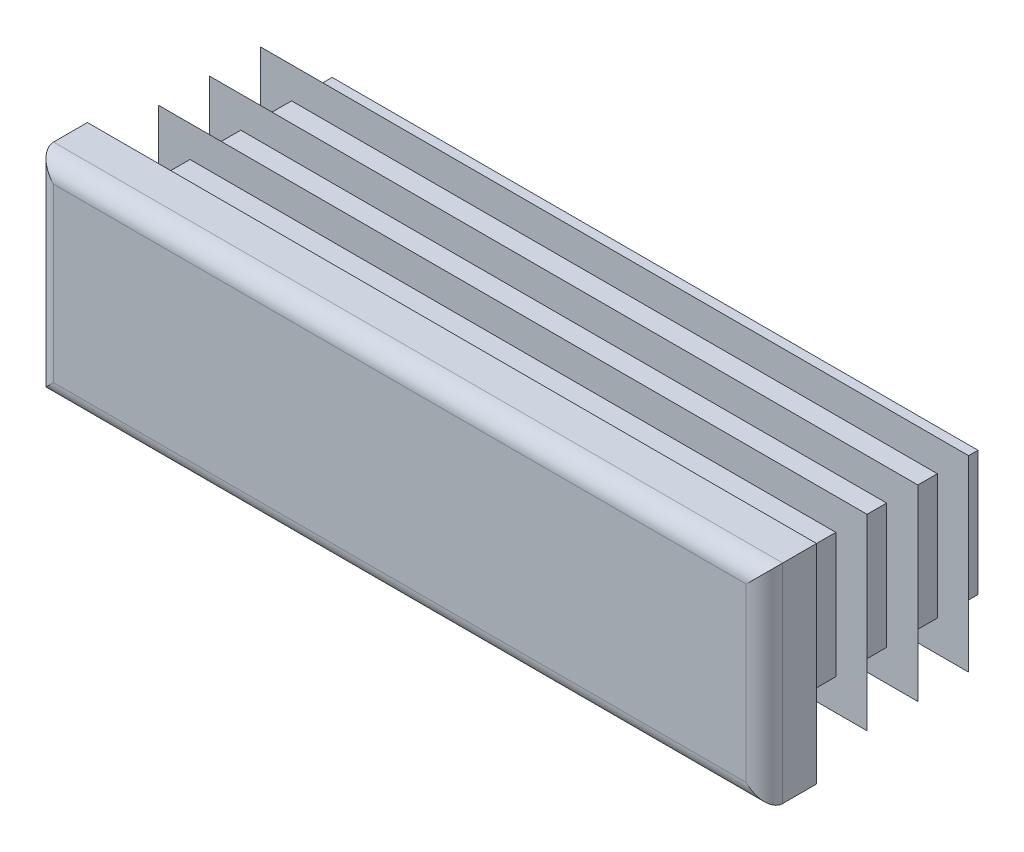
ISO-10303-21;
HEADER;
FILE_DESCRIPTION(('STEP AP214'),'2;1');
FILE_NAME('part.step','',(''),(''),'','','');
FILE_SCHEMA(('AUTOMOTIVE_DESIGN { 1 0 10303 214 1 1 1 1 }'));
ENDSEC;
DATA;
#1=APPLICATION_CONTEXT('core data for automotive mechanical design processes');
#2=APPLICATION_PROTOCOL_DEFINITION('international standard','automotive_design',2000,#1);
#3=PRODUCT_CONTEXT('',#1,'mechanical');
#4=PRODUCT('Part','Part','',(#3));
#5=PRODUCT_RELATED_PRODUCT_CATEGORY('part','',(#4));
#6=PRODUCT_DEFINITION_FORMATION('','',#4);
#7=PRODUCT_DEFINITION_CONTEXT('part definition',#1,'design');
#8=PRODUCT_DEFINITION('design','',#6,#7);
#9=PRODUCT_DEFINITION_SHAPE('','',#8);
#10=(LENGTH_UNIT() NAMED_UNIT(*) SI_UNIT(.MILLI.,.METRE.));
#11=(NAMED_UNIT(*) PLANE_ANGLE_UNIT() SI_UNIT($,.RADIAN.));
#12=(NAMED_UNIT(*) SI_UNIT($,.STERADIAN.) SOLID_ANGLE_UNIT());
#13=UNCERTAINTY_MEASURE_WITH_UNIT(LENGTH_MEASURE(1.E-05),#10,'distance_accuracy_value','');
#14=(GEOMETRIC_REPRESENTATION_CONTEXT(3) GLOBAL_UNCERTAINTY_ASSIGNED_CONTEXT((#13)) GLOBAL_UNIT_ASSIGNED_CONTEXT((#10,
#11,#12)) REPRESENTATION_CONTEXT('',''));
#15=CARTESIAN_POINT('',(0.,0.,0.));
#16=DIRECTION('',(0.,0.,1.));
#17=DIRECTION('',(1.,0.,0.));
#18=AXIS2_PLACEMENT_3D('',#15,#16,#17);
#19=CARTESIAN_POINT('',(33.25,-10.,5.));
#20=DIRECTION('',(0.,0.,-1.));
#21=DIRECTION('',(0.,1.,0.));
#22=AXIS2_PLACEMENT_3D('',#19,#20,#21);
#23=PLANE('',#22);
#24=DIRECTION('',(0.,1.,0.));
#25=VECTOR('',#24,1.);
#26=CARTESIAN_POINT('',(-33.25,-10.,5.));
#27=LINE('',#26,#25);
#28=CARTESIAN_POINT('',(-33.25,-8.25,5.));
#29=VERTEX_POINT('',#28);
#30=CARTESIAN_POINT('',(-33.25,8.25,5.));
#31=VERTEX_POINT('',#30);
#32=EDGE_CURVE('E310',#29,#31,#27,.T.);
#33=ORIENTED_EDGE('',*,*,#32,.F.);
#34=DIRECTION('',(-1.,0.,0.));
#35=VECTOR('',#34,1.);
#36=CARTESIAN_POINT('',(35.,-8.25,5.));
#37=LINE('',#36,#35);
#38=CARTESIAN_POINT('',(33.25,-8.25,5.));
#39=VERTEX_POINT('',#38);
#40=EDGE_CURVE('E482',#39,#29,#37,.T.);
#41=ORIENTED_EDGE('',*,*,#40,.F.);
#42=DIRECTION('',(0.,1.,0.));
#43=VECTOR('',#42,1.);
#44=CARTESIAN_POINT('',(33.25,-10.,5.));
#45=LINE('',#44,#43);
#46=CARTESIAN_POINT('',(33.25,8.25,5.));
#47=VERTEX_POINT('',#46);
#48=EDGE_CURVE('E305',#39,#47,#45,.T.);
#49=ORIENTED_EDGE('',*,*,#48,.T.);
#50=DIRECTION('',(-1.,0.,0.));
#51=VECTOR('',#50,1.);
#52=CARTESIAN_POINT('',(35.,8.25,5.));
#53=LINE('',#52,#51);
#54=EDGE_CURVE('E630',#47,#31,#53,.T.);
#55=ORIENTED_EDGE('',*,*,#54,.T.);
#56=EDGE_LOOP('',(#33,#41,#49,#55));
#57=FACE_BOUND('',#56,.T.);
#58=ADVANCED_FACE('F14',(#57),#23,.F.);
#59=CARTESIAN_POINT('',(-33.25,-10.,3.25));
#60=DIRECTION('',(0.,1.,0.));
#61=DIRECTION('',(-1.,0.,0.));
#62=AXIS2_PLACEMENT_3D('',#59,#60,#61);
#63=CYLINDRICAL_SURFACE('',#62,1.75);
#64=DIRECTION('',(0.,1.,0.));
#65=VECTOR('',#64,1.);
#66=CARTESIAN_POINT('',(-35.,-10.,3.25));
#67=LINE('',#66,#65);
#68=CARTESIAN_POINT('',(-35.,-10.,3.25));
#69=VERTEX_POINT('',#68);
#70=CARTESIAN_POINT('',(-35.,10.,3.25));
#71=VERTEX_POINT('',#70);
#72=EDGE_CURVE('E402',#69,#71,#67,.T.);
#73=ORIENTED_EDGE('',*,*,#72,.F.);
#74=CARTESIAN_POINT('',(-33.25,-8.25,3.25));
#75=DIRECTION('',(-0.707106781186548,0.707106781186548,0.));
#76=DIRECTION('',(0.707106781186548,0.707106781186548,0.));
#77=AXIS2_PLACEMENT_3D('',#74,#75,#76);
#78=ELLIPSE('',#77,2.47487373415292,1.75);
#79=EDGE_CURVE('E59',#69,#29,#78,.T.);
#80=ORIENTED_EDGE('',*,*,#79,.T.);
#81=ORIENTED_EDGE('',*,*,#32,.T.);
#82=CARTESIAN_POINT('',(-33.25,8.25,3.25));
#83=DIRECTION('',(0.707106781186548,0.707106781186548,0.));
#84=DIRECTION('',(-0.707106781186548,0.707106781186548,0.));
#85=AXIS2_PLACEMENT_3D('',#82,#83,#84);
#86=ELLIPSE('',#85,2.47487373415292,1.75);
#87=EDGE_CURVE('E306',#31,#71,#86,.F.);
#88=ORIENTED_EDGE('',*,*,#87,.T.);
#89=EDGE_LOOP('',(#73,#80,#81,#88));
#90=FACE_BOUND('',#89,.T.);
#91=ADVANCED_FACE('F16',(#90),#63,.T.);
#92=CARTESIAN_POINT('',(-35.,-10.,3.25));
#93=DIRECTION('',(1.,0.,0.));
#94=DIRECTION('',(0.,1.,0.));
#95=AXIS2_PLACEMENT_3D('',#92,#93,#94);
#96=PLANE('',#95);
#97=DIRECTION('',(0.,0.,-1.));
#98=VECTOR('',#97,1.);
#99=CARTESIAN_POINT('',(-35.,10.,3.25));
#100=LINE('',#99,#98);
#101=CARTESIAN_POINT('',(-35.,10.,0.));
#102=VERTEX_POINT('',#101);
#103=EDGE_CURVE('E615',#71,#102,#100,.T.);
#104=ORIENTED_EDGE('',*,*,#103,.T.);
#105=DIRECTION('',(0.,1.,0.));
#106=VECTOR('',#105,1.);
#107=CARTESIAN_POINT('',(-35.,-10.,0.));
#108=LINE('',#107,#106);
#109=CARTESIAN_POINT('',(-35.,-10.,0.));
#110=VERTEX_POINT('',#109);
#111=EDGE_CURVE('E400',#110,#102,#108,.T.);
#112=ORIENTED_EDGE('',*,*,#111,.F.);
#113=DIRECTION('',(0.,0.,-1.));
#114=VECTOR('',#113,1.);
#115=CARTESIAN_POINT('',(-35.,-10.,3.25));
#116=LINE('',#115,#114);
#117=EDGE_CURVE('E616',#69,#110,#116,.T.);
#118=ORIENTED_EDGE('',*,*,#117,.F.);
#119=ORIENTED_EDGE('',*,*,#72,.T.);
#120=EDGE_LOOP('',(#104,#112,#118,#119));
#121=FACE_BOUND('',#120,.T.);
#122=ADVANCED_FACE('F697',(#121),#96,.F.);
#123=CARTESIAN_POINT('',(-31.,-10.,0.));
#124=DIRECTION('',(1.,0.,0.));
#125=DIRECTION('',(0.,1.,0.));
#126=AXIS2_PLACEMENT_3D('',#123,#124,#125);
#127=PLANE('',#126);
#128=DIRECTION('',(0.,1.,0.));
#129=VECTOR('',#128,1.);
#130=CARTESIAN_POINT('',(-31.,-10.,0.));
#131=LINE('',#130,#129);
#132=CARTESIAN_POINT('',(-31.,-6.,0.));
#133=VERTEX_POINT('',#132);
#134=CARTESIAN_POINT('',(-31.,6.,0.));
#135=VERTEX_POINT('',#134);
#136=EDGE_CURVE('E397',#133,#135,#131,.T.);
#137=ORIENTED_EDGE('',*,*,#136,.T.);
#138=DIRECTION('',(0.,0.,-1.));
#139=VECTOR('',#138,1.);
#140=CARTESIAN_POINT('',(-31.,6.,0.));
#141=LINE('',#140,#139);
#142=CARTESIAN_POINT('',(-31.,6.,-0.975));
#143=VERTEX_POINT('',#142);
#144=EDGE_CURVE('E495',#135,#143,#141,.T.);
#145=ORIENTED_EDGE('',*,*,#144,.T.);
#146=DIRECTION('',(0.,1.,0.));
#147=VECTOR('',#146,1.);
#148=CARTESIAN_POINT('',(-31.,-10.,-0.975));
#149=LINE('',#148,#147);
#150=CARTESIAN_POINT('',(-31.,-6.,-0.975));
#151=VERTEX_POINT('',#150);
#152=EDGE_CURVE('E394',#151,#143,#149,.T.);
#153=ORIENTED_EDGE('',*,*,#152,.F.);
#154=DIRECTION('',(0.,0.,1.));
#155=VECTOR('',#154,1.);
#156=CARTESIAN_POINT('',(-31.,-6.,0.));
#157=LINE('',#156,#155);
#158=EDGE_CURVE('E489',#151,#133,#157,.T.);
#159=ORIENTED_EDGE('',*,*,#158,.T.);
#160=EDGE_LOOP('',(#137,#145,#153,#159));
#161=FACE_BOUND('',#160,.T.);
#162=ADVANCED_FACE('F787',(#161),#127,.F.);
#163=CARTESIAN_POINT('',(-34.,-10.,-0.975));
#164=DIRECTION('',(0.342020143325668,0.,0.939692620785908));
#165=DIRECTION('',(-0.939692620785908,0.,0.342020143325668));
#166=AXIS2_PLACEMENT_3D('',#163,#164,#165);
#167=PLANE('',#166);
#168=DIRECTION('',(0.,1.,0.));
#169=VECTOR('',#168,1.);
#170=CARTESIAN_POINT('',(-34.,-10.,-0.975));
#171=LINE('',#170,#169);
#172=CARTESIAN_POINT('',(-34.,-9.,-0.975));
#173=VERTEX_POINT('',#172);
#174=CARTESIAN_POINT('',(-34.,9.,-0.975));
#175=VERTEX_POINT('',#174);
#176=EDGE_CURVE('E392',#173,#175,#171,.T.);
#177=ORIENTED_EDGE('',*,*,#176,.T.);
#178=DIRECTION('',(0.844349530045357,-0.438895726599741,-0.307318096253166));
#179=VECTOR('',#178,1.);
#180=CARTESIAN_POINT('',(-26.9589533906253,5.34004028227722,-3.53773138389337));
#181=LINE('',#180,#179);
#182=CARTESIAN_POINT('',(-31.,7.44058990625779,-2.06691070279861));
#183=VERTEX_POINT('',#182);
#184=EDGE_CURVE('E519',#175,#183,#181,.T.);
#185=ORIENTED_EDGE('',*,*,#184,.T.);
#186=DIRECTION('',(0.,1.,0.));
#187=VECTOR('',#186,1.);
#188=CARTESIAN_POINT('',(-31.,-10.,-2.06691070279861));
#189=LINE('',#188,#187);
#190=CARTESIAN_POINT('',(-31.,-7.44058990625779,-2.06691070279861));
#191=VERTEX_POINT('',#190);
#192=EDGE_CURVE('E389',#191,#183,#189,.T.);
#193=ORIENTED_EDGE('',*,*,#192,.F.);
#194=DIRECTION('',(-0.844349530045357,-0.43889572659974,0.307318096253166));
#195=VECTOR('',#194,1.);
#196=CARTESIAN_POINT('',(-34.3705814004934,-9.19262945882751,-0.840119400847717));
#197=LINE('',#196,#195);
#198=EDGE_CURVE('E507',#191,#173,#197,.T.);
#199=ORIENTED_EDGE('',*,*,#198,.T.);
#200=EDGE_LOOP('',(#177,#185,#193,#199));
#201=FACE_BOUND('',#200,.T.);
#202=ADVANCED_FACE('F783',(#201),#167,.F.);
#203=CARTESIAN_POINT('',(-31.,-10.,-2.06691070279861));
#204=DIRECTION('',(1.,0.,0.));
#205=DIRECTION('',(0.,1.,0.));
#206=AXIS2_PLACEMENT_3D('',#203,#204,#205);
#207=PLANE('',#206);
#208=ORIENTED_EDGE('',*,*,#192,.T.);
#209=DIRECTION('',(0.,-0.819152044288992,-0.573576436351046));
#210=VECTOR('',#209,1.);
#211=CARTESIAN_POINT('',(-31.,-4.26222157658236,-10.2613075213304));
#212=LINE('',#211,#210);
#213=CARTESIAN_POINT('',(-31.,6.,-3.07562261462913));
#214=VERTEX_POINT('',#213);
#215=EDGE_CURVE('E516',#183,#214,#212,.T.);
#216=ORIENTED_EDGE('',*,*,#215,.T.);
#217=DIRECTION('',(0.,0.,-1.));
#218=VECTOR('',#217,1.);
#219=CARTESIAN_POINT('',(-31.,6.,-2.06691070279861));
#220=LINE('',#219,#218);
#221=CARTESIAN_POINT('',(-31.,6.,-5.85));
#222=VERTEX_POINT('',#221);
#223=EDGE_CURVE('E525',#214,#222,#220,.T.);
#224=ORIENTED_EDGE('',*,*,#223,.T.);
#225=DIRECTION('',(0.,1.,0.));
#226=VECTOR('',#225,1.);
#227=CARTESIAN_POINT('',(-31.,-10.,-5.85));
#228=LINE('',#227,#226);
#229=CARTESIAN_POINT('',(-31.,-6.,-5.85));
#230=VERTEX_POINT('',#229);
#231=EDGE_CURVE('E386',#230,#222,#228,.T.);
#232=ORIENTED_EDGE('',*,*,#231,.F.);
#233=DIRECTION('',(0.,0.,1.));
#234=VECTOR('',#233,1.);
#235=CARTESIAN_POINT('',(-31.,-6.,-2.06691070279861));
#236=LINE('',#235,#234);
#237=CARTESIAN_POINT('',(-31.,-6.,-3.07562261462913));
#238=VERTEX_POINT('',#237);
#239=EDGE_CURVE('E522',#230,#238,#236,.T.);
#240=ORIENTED_EDGE('',*,*,#239,.T.);
#241=DIRECTION('',(0.,-0.819152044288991,0.573576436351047));
#242=VECTOR('',#241,1.);
#243=CARTESIAN_POINT('',(-31.,-9.15797985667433,-0.864381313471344));
#244=LINE('',#243,#242);
#245=EDGE_CURVE('E504',#238,#191,#244,.T.);
#246=ORIENTED_EDGE('',*,*,#245,.T.);
#247=EDGE_LOOP('',(#208,#216,#224,#232,#240,#246));
#248=FACE_BOUND('',#247,.T.);
#249=ADVANCED_FACE('F779',(#248),#207,.F.);
#250=CARTESIAN_POINT('',(-34.,-10.,-5.85));
#251=DIRECTION('',(0.342020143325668,0.,0.939692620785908));
#252=DIRECTION('',(-0.939692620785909,0.,0.342020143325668));
#253=AXIS2_PLACEMENT_3D('',#250,#251,#252);
#254=PLANE('',#253);
#255=DIRECTION('',(0.,1.,0.));
#256=VECTOR('',#255,1.);
#257=CARTESIAN_POINT('',(-34.,-10.,-5.85));
#258=LINE('',#257,#256);
#259=CARTESIAN_POINT('',(-34.,-9.,-5.85));
#260=VERTEX_POINT('',#259);
#261=CARTESIAN_POINT('',(-34.,9.,-5.85));
#262=VERTEX_POINT('',#261);
#263=EDGE_CURVE('E384',#260,#262,#258,.T.);
#264=ORIENTED_EDGE('',*,*,#263,.T.);
#265=DIRECTION('',(0.844349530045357,-0.438895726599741,-0.307318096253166));
#266=VECTOR('',#265,1.);
#267=CARTESIAN_POINT('',(-26.9589533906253,5.34004028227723,-8.41273138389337));
#268=LINE('',#267,#266);
#269=CARTESIAN_POINT('',(-31.,7.44058990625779,-6.94191070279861));
#270=VERTEX_POINT('',#269);
#271=EDGE_CURVE('E549',#262,#270,#268,.T.);
#272=ORIENTED_EDGE('',*,*,#271,.T.);
#273=DIRECTION('',(0.,1.,0.));
#274=VECTOR('',#273,1.);
#275=CARTESIAN_POINT('',(-31.,-10.,-6.94191070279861));
#276=LINE('',#275,#274);
#277=CARTESIAN_POINT('',(-31.,-7.44058990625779,-6.94191070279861));
#278=VERTEX_POINT('',#277);
#279=EDGE_CURVE('E381',#278,#270,#276,.T.);
#280=ORIENTED_EDGE('',*,*,#279,.F.);
#281=DIRECTION('',(-0.844349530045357,-0.43889572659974,0.307318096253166));
#282=VECTOR('',#281,1.);
#283=CARTESIAN_POINT('',(-34.3705814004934,-9.19262945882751,-5.71511940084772));
#284=LINE('',#283,#282);
#285=EDGE_CURVE('E537',#278,#260,#284,.T.);
#286=ORIENTED_EDGE('',*,*,#285,.T.);
#287=EDGE_LOOP('',(#264,#272,#280,#286));
#288=FACE_BOUND('',#287,.T.);
#289=ADVANCED_FACE('F775',(#288),#254,.F.);
#290=CARTESIAN_POINT('',(-31.,-10.,-6.94191070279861));
#291=DIRECTION('',(1.,0.,0.));
#292=DIRECTION('',(0.,1.,0.));
#293=AXIS2_PLACEMENT_3D('',#290,#291,#292);
#294=PLANE('',#293);
#295=ORIENTED_EDGE('',*,*,#279,.T.);
#296=DIRECTION('',(0.,-0.819152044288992,-0.573576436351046));
#297=VECTOR('',#296,1.);
#298=CARTESIAN_POINT('',(-31.,-4.26222157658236,-15.1363075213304));
#299=LINE('',#298,#297);
#300=CARTESIAN_POINT('',(-31.,6.,-7.95062261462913));
#301=VERTEX_POINT('',#300);
#302=EDGE_CURVE('E546',#270,#301,#299,.T.);
#303=ORIENTED_EDGE('',*,*,#302,.T.);
#304=DIRECTION('',(0.,0.,-1.));
#305=VECTOR('',#304,1.);
#306=CARTESIAN_POINT('',(-31.,6.,-6.94191070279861));
#307=LINE('',#306,#305);
#308=CARTESIAN_POINT('',(-31.,6.,-10.725));
#309=VERTEX_POINT('',#308);
#310=EDGE_CURVE('E555',#301,#309,#307,.T.);
#311=ORIENTED_EDGE('',*,*,#310,.T.);
#312=DIRECTION('',(0.,1.,0.));
#313=VECTOR('',#312,1.);
#314=CARTESIAN_POINT('',(-31.,-10.,-10.725));
#315=LINE('',#314,#313);
#316=CARTESIAN_POINT('',(-31.,-6.,-10.725));
#317=VERTEX_POINT('',#316);
#318=EDGE_CURVE('E378',#317,#309,#315,.T.);
#319=ORIENTED_EDGE('',*,*,#318,.F.);
#320=DIRECTION('',(0.,0.,1.));
#321=VECTOR('',#320,1.);
#322=CARTESIAN_POINT('',(-31.,-6.,-6.94191070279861));
#323=LINE('',#322,#321);
#324=CARTESIAN_POINT('',(-31.,-6.,-7.95062261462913));
#325=VERTEX_POINT('',#324);
#326=EDGE_CURVE('E552',#317,#325,#323,.T.);
#327=ORIENTED_EDGE('',*,*,#326,.T.);
#328=DIRECTION('',(0.,-0.819152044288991,0.573576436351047));
#329=VECTOR('',#328,1.);
#330=CARTESIAN_POINT('',(-31.,-9.15797985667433,-5.73938131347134));
#331=LINE('',#330,#329);
#332=EDGE_CURVE('E534',#325,#278,#331,.T.);
#333=ORIENTED_EDGE('',*,*,#332,.T.);
#334=EDGE_LOOP('',(#295,#303,#311,#319,#327,#333));
#335=FACE_BOUND('',#334,.T.);
#336=ADVANCED_FACE('F771',(#335),#294,.F.);
#337=CARTESIAN_POINT('',(-34.,-10.,-10.725));
#338=DIRECTION('',(0.342020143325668,0.,0.939692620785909));
#339=DIRECTION('',(-0.939692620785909,0.,0.342020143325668));
#340=AXIS2_PLACEMENT_3D('',#337,#338,#339);
#341=PLANE('',#340);
#342=DIRECTION('',(0.,1.,0.));
#343=VECTOR('',#342,1.);
#344=CARTESIAN_POINT('',(-34.,-10.,-10.725));
#345=LINE('',#344,#343);
#346=CARTESIAN_POINT('',(-34.,-9.,-10.725));
#347=VERTEX_POINT('',#346);
#348=CARTESIAN_POINT('',(-34.,9.,-10.725));
#349=VERTEX_POINT('',#348);
#350=EDGE_CURVE('E376',#347,#349,#345,.T.);
#351=ORIENTED_EDGE('',*,*,#350,.T.);
#352=DIRECTION('',(0.844349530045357,-0.438895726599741,-0.307318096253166));
#353=VECTOR('',#352,1.);
#354=CARTESIAN_POINT('',(-26.9589533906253,5.34004028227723,-13.2877313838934));
#355=LINE('',#354,#353);
#356=CARTESIAN_POINT('',(-31.,7.44058990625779,-11.8169107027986));
#357=VERTEX_POINT('',#356);
#358=EDGE_CURVE('E579',#349,#357,#355,.T.);
#359=ORIENTED_EDGE('',*,*,#358,.T.);
#360=DIRECTION('',(0.,1.,0.));
#361=VECTOR('',#360,1.);
#362=CARTESIAN_POINT('',(-31.,-10.,-11.8169107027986));
#363=LINE('',#362,#361);
#364=CARTESIAN_POINT('',(-31.,-7.44058990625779,-11.8169107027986));
#365=VERTEX_POINT('',#364);
#366=EDGE_CURVE('E373',#365,#357,#363,.T.);
#367=ORIENTED_EDGE('',*,*,#366,.F.);
#368=DIRECTION('',(-0.844349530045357,-0.438895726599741,0.307318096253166));
#369=VECTOR('',#368,1.);
#370=CARTESIAN_POINT('',(-34.3705814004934,-9.19262945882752,-10.5901194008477));
#371=LINE('',#370,#369);
#372=EDGE_CURVE('E567',#365,#347,#371,.T.);
#373=ORIENTED_EDGE('',*,*,#372,.T.);
#374=EDGE_LOOP('',(#351,#359,#367,#373));
#375=FACE_BOUND('',#374,.T.);
#376=ADVANCED_FACE('F767',(#375),#341,.F.);
#377=CARTESIAN_POINT('',(-31.,-10.,-11.8169107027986));
#378=DIRECTION('',(1.,0.,0.));
#379=DIRECTION('',(0.,1.,0.));
#380=AXIS2_PLACEMENT_3D('',#377,#378,#379);
#381=PLANE('',#380);
#382=ORIENTED_EDGE('',*,*,#366,.T.);
#383=DIRECTION('',(0.,-0.819152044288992,-0.573576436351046));
#384=VECTOR('',#383,1.);
#385=CARTESIAN_POINT('',(-31.,-4.26222157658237,-20.0113075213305));
#386=LINE('',#385,#384);
#387=CARTESIAN_POINT('',(-31.,6.,-12.8256226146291));
#388=VERTEX_POINT('',#387);
#389=EDGE_CURVE('E576',#357,#388,#386,.T.);
#390=ORIENTED_EDGE('',*,*,#389,.T.);
#391=DIRECTION('',(0.,0.,-1.));
#392=VECTOR('',#391,1.);
#393=CARTESIAN_POINT('',(-31.,6.,-11.8169107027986));
#394=LINE('',#393,#392);
#395=CARTESIAN_POINT('',(-31.,6.,-15.6));
#396=VERTEX_POINT('',#395);
#397=EDGE_CURVE('E585',#388,#396,#394,.T.);
#398=ORIENTED_EDGE('',*,*,#397,.T.);
#399=DIRECTION('',(0.,1.,0.));
#400=VECTOR('',#399,1.);
#401=CARTESIAN_POINT('',(-31.,-10.,-15.6));
#402=LINE('',#401,#400);
#403=CARTESIAN_POINT('',(-31.,-6.,-15.6));
#404=VERTEX_POINT('',#403);
#405=EDGE_CURVE('E370',#404,#396,#402,.T.);
#406=ORIENTED_EDGE('',*,*,#405,.F.);
#407=DIRECTION('',(0.,0.,1.));
#408=VECTOR('',#407,1.);
#409=CARTESIAN_POINT('',(-31.,-6.,-11.8169107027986));
#410=LINE('',#409,#408);
#411=CARTESIAN_POINT('',(-31.,-6.,-12.8256226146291));
#412=VERTEX_POINT('',#411);
#413=EDGE_CURVE('E582',#404,#412,#410,.T.);
#414=ORIENTED_EDGE('',*,*,#413,.T.);
#415=DIRECTION('',(0.,-0.819152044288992,0.573576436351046));
#416=VECTOR('',#415,1.);
#417=CARTESIAN_POINT('',(-31.,-9.15797985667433,-10.6143813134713));
#418=LINE('',#417,#416);
#419=EDGE_CURVE('E564',#412,#365,#418,.T.);
#420=ORIENTED_EDGE('',*,*,#419,.T.);
#421=EDGE_LOOP('',(#382,#390,#398,#406,#414,#420));
#422=FACE_BOUND('',#421,.T.);
#423=ADVANCED_FACE('F764',(#422),#381,.F.);
#424=CARTESIAN_POINT('',(-34.,-10.,-15.6));
#425=DIRECTION('',(0.342020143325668,0.,0.939692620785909));
#426=DIRECTION('',(-0.939692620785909,0.,0.342020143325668));
#427=AXIS2_PLACEMENT_3D('',#424,#425,#426);
#428=PLANE('',#427);
#429=DIRECTION('',(0.,1.,0.));
#430=VECTOR('',#429,1.);
#431=CARTESIAN_POINT('',(-34.,-10.,-15.6));
#432=LINE('',#431,#430);
#433=CARTESIAN_POINT('',(-34.,-9.,-15.6));
#434=VERTEX_POINT('',#433);
#435=CARTESIAN_POINT('',(-34.,9.,-15.6));
#436=VERTEX_POINT('',#435);
#437=EDGE_CURVE('E368',#434,#436,#432,.T.);
#438=ORIENTED_EDGE('',*,*,#437,.T.);
#439=DIRECTION('',(0.844349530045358,-0.43889572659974,-0.307318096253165));
#440=VECTOR('',#439,1.);
#441=CARTESIAN_POINT('',(-26.9589533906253,5.34004028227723,-18.1627313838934));
#442=LINE('',#441,#440);
#443=CARTESIAN_POINT('',(-31.,7.44058990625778,-16.6919107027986));
#444=VERTEX_POINT('',#443);
#445=EDGE_CURVE('E607',#436,#444,#442,.T.);
#446=ORIENTED_EDGE('',*,*,#445,.T.);
#447=DIRECTION('',(0.,1.,0.));
#448=VECTOR('',#447,1.);
#449=CARTESIAN_POINT('',(-31.,-10.,-16.6919107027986));
#450=LINE('',#449,#448);
#451=CARTESIAN_POINT('',(-31.,-7.44058990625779,-16.6919107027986));
#452=VERTEX_POINT('',#451);
#453=EDGE_CURVE('E365',#452,#444,#450,.T.);
#454=ORIENTED_EDGE('',*,*,#453,.F.);
#455=DIRECTION('',(-0.844349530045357,-0.43889572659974,0.307318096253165));
#456=VECTOR('',#455,1.);
#457=CARTESIAN_POINT('',(-34.3705814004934,-9.19262945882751,-15.4651194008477));
#458=LINE('',#457,#456);
#459=EDGE_CURVE('E595',#452,#434,#458,.T.);
#460=ORIENTED_EDGE('',*,*,#459,.T.);
#461=EDGE_LOOP('',(#438,#446,#454,#460));
#462=FACE_BOUND('',#461,.T.);
#463=ADVANCED_FACE('F675',(#462),#428,.F.);
#464=CARTESIAN_POINT('',(-31.,-10.,-16.6919107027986));
#465=DIRECTION('',(1.,0.,0.));
#466=DIRECTION('',(0.,1.,0.));
#467=AXIS2_PLACEMENT_3D('',#464,#465,#466);
#468=PLANE('',#467);
#469=ORIENTED_EDGE('',*,*,#453,.T.);
#470=DIRECTION('',(0.,-0.819152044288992,-0.573576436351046));
#471=VECTOR('',#470,1.);
#472=CARTESIAN_POINT('',(-31.,-4.26222157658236,-24.8863075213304));
#473=LINE('',#472,#471);
#474=CARTESIAN_POINT('',(-31.,6.,-17.7006226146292));
#475=VERTEX_POINT('',#474);
#476=EDGE_CURVE('E604',#444,#475,#473,.T.);
#477=ORIENTED_EDGE('',*,*,#476,.T.);
#478=DIRECTION('',(0.,0.,-1.));
#479=VECTOR('',#478,1.);
#480=CARTESIAN_POINT('',(-31.,6.,-16.6919107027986));
#481=LINE('',#480,#479);
#482=CARTESIAN_POINT('',(-31.,6.,-19.5));
#483=VERTEX_POINT('',#482);
#484=EDGE_CURVE('E613',#475,#483,#481,.T.);
#485=ORIENTED_EDGE('',*,*,#484,.T.);
#486=DIRECTION('',(0.,1.,0.));
#487=VECTOR('',#486,1.);
#488=CARTESIAN_POINT('',(-31.,-10.,-19.5));
#489=LINE('',#488,#487);
#490=CARTESIAN_POINT('',(-31.,-6.,-19.5));
#491=VERTEX_POINT('',#490);
#492=EDGE_CURVE('E362',#491,#483,#489,.T.);
#493=ORIENTED_EDGE('',*,*,#492,.F.);
#494=DIRECTION('',(0.,0.,1.));
#495=VECTOR('',#494,1.);
#496=CARTESIAN_POINT('',(-31.,-6.,-16.6919107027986));
#497=LINE('',#496,#495);
#498=CARTESIAN_POINT('',(-31.,-6.,-17.7006226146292));
#499=VERTEX_POINT('',#498);
#500=EDGE_CURVE('E610',#491,#499,#497,.T.);
#501=ORIENTED_EDGE('',*,*,#500,.T.);
#502=DIRECTION('',(0.,-0.819152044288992,0.573576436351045));
#503=VECTOR('',#502,1.);
#504=CARTESIAN_POINT('',(-31.,-9.15797985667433,-15.4893813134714));
#505=LINE('',#504,#503);
#506=EDGE_CURVE('E592',#499,#452,#505,.T.);
#507=ORIENTED_EDGE('',*,*,#506,.T.);
#508=EDGE_LOOP('',(#469,#477,#485,#493,#501,#507));
#509=FACE_BOUND('',#508,.T.);
#510=ADVANCED_FACE('F677',(#509),#468,.F.);
#511=CARTESIAN_POINT('',(-31.,-10.,-19.5));
#512=DIRECTION('',(0.,0.,1.));
#513=DIRECTION('',(0.,-1.,0.));
#514=AXIS2_PLACEMENT_3D('',#511,#512,#513);
#515=PLANE('',#514);
#516=ORIENTED_EDGE('',*,*,#492,.T.);
#517=DIRECTION('',(-1.,0.,0.));
#518=VECTOR('',#517,1.);
#519=CARTESIAN_POINT('',(35.,6.,-19.5));
#520=LINE('',#519,#518);
#521=CARTESIAN_POINT('',(31.,6.,-19.5));
#522=VERTEX_POINT('',#521);
#523=EDGE_CURVE('E438',#522,#483,#520,.T.);
#524=ORIENTED_EDGE('',*,*,#523,.F.);
#525=DIRECTION('',(0.,1.,0.));
#526=VECTOR('',#525,1.);
#527=CARTESIAN_POINT('',(31.,-10.,-19.5));
#528=LINE('',#527,#526);
#529=CARTESIAN_POINT('',(31.,-6.,-19.5));
#530=VERTEX_POINT('',#529);
#531=EDGE_CURVE('E359',#530,#522,#528,.T.);
#532=ORIENTED_EDGE('',*,*,#531,.F.);
#533=DIRECTION('',(-1.,0.,0.));
#534=VECTOR('',#533,1.);
#535=CARTESIAN_POINT('',(35.,-6.,-19.5));
#536=LINE('',#535,#534);
#537=EDGE_CURVE('E436',#530,#491,#536,.T.);
#538=ORIENTED_EDGE('',*,*,#537,.T.);
#539=EDGE_LOOP('',(#516,#524,#532,#538));
#540=FACE_BOUND('',#539,.T.);
#541=ADVANCED_FACE('F435',(#540),#515,.F.);
#542=CARTESIAN_POINT('',(31.,-10.,-19.5));
#543=DIRECTION('',(-1.,0.,0.));
#544=DIRECTION('',(0.,-1.,0.));
#545=AXIS2_PLACEMENT_3D('',#542,#543,#544);
#546=PLANE('',#545);
#547=DIRECTION('',(0.,0.,1.));
#548=VECTOR('',#547,1.);
#549=CARTESIAN_POINT('',(31.,6.,-19.5));
#550=LINE('',#549,#548);
#551=CARTESIAN_POINT('',(31.,6.,-17.7006226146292));
#552=VERTEX_POINT('',#551);
#553=EDGE_CURVE('E9',#522,#552,#550,.T.);
#554=ORIENTED_EDGE('',*,*,#553,.T.);
#555=DIRECTION('',(0.,0.819152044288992,0.573576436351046));
#556=VECTOR('',#555,1.);
#557=CARTESIAN_POINT('',(31.,-5.58159197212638,-25.8101406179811));
#558=LINE('',#557,#556);
#559=CARTESIAN_POINT('',(31.,7.44058990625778,-16.6919107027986));
#560=VERTEX_POINT('',#559);
#561=EDGE_CURVE('E601',#552,#560,#558,.T.);
#562=ORIENTED_EDGE('',*,*,#561,.T.);
#563=DIRECTION('',(0.,1.,0.));
#564=VECTOR('',#563,1.);
#565=CARTESIAN_POINT('',(31.,-10.,-16.6919107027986));
#566=LINE('',#565,#564);
#567=CARTESIAN_POINT('',(31.,-7.44058990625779,-16.6919107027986));
#568=VERTEX_POINT('',#567);
#569=EDGE_CURVE('E356',#568,#560,#566,.T.);
#570=ORIENTED_EDGE('',*,*,#569,.F.);
#571=DIRECTION('',(0.,0.819152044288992,-0.573576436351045));
#572=VECTOR('',#571,1.);
#573=CARTESIAN_POINT('',(31.,-7.83860946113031,-16.413214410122));
#574=LINE('',#573,#572);
#575=CARTESIAN_POINT('',(31.,-6.,-17.7006226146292));
#576=VERTEX_POINT('',#575);
#577=EDGE_CURVE('E428',#568,#576,#574,.T.);
#578=ORIENTED_EDGE('',*,*,#577,.T.);
#579=DIRECTION('',(0.,0.,-1.));
#580=VECTOR('',#579,1.);
#581=CARTESIAN_POINT('',(31.,-6.,-19.5));
#582=LINE('',#581,#580);
#583=EDGE_CURVE('E23',#576,#530,#582,.T.);
#584=ORIENTED_EDGE('',*,*,#583,.T.);
#585=ORIENTED_EDGE('',*,*,#531,.T.);
#586=EDGE_LOOP('',(#554,#562,#570,#578,#584,#585));
#587=FACE_BOUND('',#586,.T.);
#588=ADVANCED_FACE('F426',(#587),#546,.F.);
#589=CARTESIAN_POINT('',(31.,-10.,-16.6919107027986));
#590=DIRECTION('',(-0.342020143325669,0.,0.939692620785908));
#591=DIRECTION('',(-0.939692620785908,0.,-0.342020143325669));
#592=AXIS2_PLACEMENT_3D('',#589,#590,#591);
#593=PLANE('',#592);
#594=ORIENTED_EDGE('',*,*,#569,.T.);
#595=DIRECTION('',(0.844349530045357,0.438895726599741,0.307318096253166));
#596=VECTOR('',#595,1.);
#597=CARTESIAN_POINT('',(24.5368417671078,4.08101851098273,-19.0443079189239));
#598=LINE('',#597,#596);
#599=CARTESIAN_POINT('',(34.,9.,-15.6));
#600=VERTEX_POINT('',#599);
#601=EDGE_CURVE('E598',#560,#600,#598,.T.);
#602=ORIENTED_EDGE('',*,*,#601,.T.);
#603=DIRECTION('',(0.,1.,0.));
#604=VECTOR('',#603,1.);
#605=CARTESIAN_POINT('',(34.,-10.,-15.6));
#606=LINE('',#605,#604);
#607=CARTESIAN_POINT('',(34.,-9.,-15.6));
#608=VERTEX_POINT('',#607);
#609=EDGE_CURVE('E353',#608,#600,#606,.T.);
#610=ORIENTED_EDGE('',*,*,#609,.F.);
#611=DIRECTION('',(-0.844349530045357,0.438895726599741,-0.307318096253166));
#612=VECTOR('',#611,1.);
#613=CARTESIAN_POINT('',(31.948469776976,-7.93360768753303,-16.3466959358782));
#614=LINE('',#613,#612);
#615=EDGE_CURVE('E588',#608,#568,#614,.T.);
#616=ORIENTED_EDGE('',*,*,#615,.T.);
#617=EDGE_LOOP('',(#594,#602,#610,#616));
#618=FACE_BOUND('',#617,.T.);
#619=ADVANCED_FACE('F752',(#618),#593,.F.);
#620=CARTESIAN_POINT('',(34.,-10.,-15.6));
#621=DIRECTION('',(0.,0.,-1.));
#622=DIRECTION('',(0.,1.,0.));
#623=AXIS2_PLACEMENT_3D('',#620,#621,#622);
#624=PLANE('',#623);
#625=ORIENTED_EDGE('',*,*,#609,.T.);
#626=DIRECTION('',(-1.,0.,0.));
#627=VECTOR('',#626,1.);
#628=CARTESIAN_POINT('',(35.,9.,-15.6));
#629=LINE('',#628,#627);
#630=EDGE_CURVE('E444',#600,#436,#629,.T.);
#631=ORIENTED_EDGE('',*,*,#630,.T.);
#632=ORIENTED_EDGE('',*,*,#437,.F.);
#633=DIRECTION('',(-1.,0.,0.));
#634=VECTOR('',#633,1.);
#635=CARTESIAN_POINT('',(35.,-9.,-15.6));
#636=LINE('',#635,#634);
#637=EDGE_CURVE('E451',#608,#434,#636,.T.);
#638=ORIENTED_EDGE('',*,*,#637,.F.);
#639=EDGE_LOOP('',(#625,#631,#632,#638));
#640=FACE_BOUND('',#639,.T.);
#641=ORIENTED_EDGE('',*,*,#405,.T.);
#642=DIRECTION('',(-1.,0.,0.));
#643=VECTOR('',#642,1.);
#644=CARTESIAN_POINT('',(35.,6.,-15.6));
#645=LINE('',#644,#643);
#646=CARTESIAN_POINT('',(31.,6.,-15.6));
#647=VERTEX_POINT('',#646);
#648=EDGE_CURVE('E663',#647,#396,#645,.T.);
#649=ORIENTED_EDGE('',*,*,#648,.F.);
#650=DIRECTION('',(0.,1.,0.));
#651=VECTOR('',#650,1.);
#652=CARTESIAN_POINT('',(31.,-10.,-15.6));
#653=LINE('',#652,#651);
#654=CARTESIAN_POINT('',(31.,-6.,-15.6));
#655=VERTEX_POINT('',#654);
#656=EDGE_CURVE('E350',#655,#647,#653,.T.);
#657=ORIENTED_EDGE('',*,*,#656,.F.);
#658=DIRECTION('',(-1.,0.,0.));
#659=VECTOR('',#658,1.);
#660=CARTESIAN_POINT('',(35.,-6.,-15.6));
#661=LINE('',#660,#659);
#662=EDGE_CURVE('E453',#655,#404,#661,.T.);
#663=ORIENTED_EDGE('',*,*,#662,.T.);
#664=EDGE_LOOP('',(#641,#649,#657,#663));
#665=FACE_BOUND('',#664,.T.);
#666=ADVANCED_FACE('F667',(#640,#665),#624,.F.);
#667=CARTESIAN_POINT('',(31.,-10.,-15.6));
#668=DIRECTION('',(-1.,0.,0.));
#669=DIRECTION('',(0.,-1.,0.));
#670=AXIS2_PLACEMENT_3D('',#667,#668,#669);
#671=PLANE('',#670);
#672=DIRECTION('',(0.,0.,1.));
#673=VECTOR('',#672,1.);
#674=CARTESIAN_POINT('',(31.,6.,-15.6));
#675=LINE('',#674,#673);
#676=CARTESIAN_POINT('',(31.,6.,-12.8256226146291));
#677=VERTEX_POINT('',#676);
#678=EDGE_CURVE('E420',#647,#677,#675,.T.);
#679=ORIENTED_EDGE('',*,*,#678,.T.);
#680=DIRECTION('',(0.,0.819152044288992,0.573576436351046));
#681=VECTOR('',#680,1.);
#682=CARTESIAN_POINT('',(31.,-6.03969212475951,-21.2559057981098));
#683=LINE('',#682,#681);
#684=CARTESIAN_POINT('',(31.,7.44058990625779,-11.8169107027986));
#685=VERTEX_POINT('',#684);
#686=EDGE_CURVE('E573',#677,#685,#683,.T.);
#687=ORIENTED_EDGE('',*,*,#686,.T.);
#688=DIRECTION('',(0.,1.,0.));
#689=VECTOR('',#688,1.);
#690=CARTESIAN_POINT('',(31.,-10.,-11.8169107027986));
#691=LINE('',#690,#689);
#692=CARTESIAN_POINT('',(31.,-7.44058990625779,-11.8169107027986));
#693=VERTEX_POINT('',#692);
#694=EDGE_CURVE('E347',#693,#685,#691,.T.);
#695=ORIENTED_EDGE('',*,*,#694,.F.);
#696=DIRECTION('',(0.,0.819152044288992,-0.573576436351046));
#697=VECTOR('',#696,1.);
#698=CARTESIAN_POINT('',(31.,-7.38050930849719,-11.8589795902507));
#699=LINE('',#698,#697);
#700=CARTESIAN_POINT('',(31.,-6.,-12.8256226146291));
#701=VERTEX_POINT('',#700);
#702=EDGE_CURVE('E561',#693,#701,#699,.T.);
#703=ORIENTED_EDGE('',*,*,#702,.T.);
#704=DIRECTION('',(0.,0.,-1.));
#705=VECTOR('',#704,1.);
#706=CARTESIAN_POINT('',(31.,-6.,-15.6));
#707=LINE('',#706,#705);
#708=EDGE_CURVE('E417',#701,#655,#707,.T.);
#709=ORIENTED_EDGE('',*,*,#708,.T.);
#710=ORIENTED_EDGE('',*,*,#656,.T.);
#711=EDGE_LOOP('',(#679,#687,#695,#703,#709,#710));
#712=FACE_BOUND('',#711,.T.);
#713=ADVANCED_FACE('F745',(#712),#671,.F.);
#714=CARTESIAN_POINT('',(31.,-10.,-11.8169107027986));
#715=DIRECTION('',(-0.342020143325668,0.,0.939692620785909));
#716=DIRECTION('',(-0.939692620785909,0.,-0.342020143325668));
#717=AXIS2_PLACEMENT_3D('',#714,#715,#716);
#718=PLANE('',#717);
#719=ORIENTED_EDGE('',*,*,#694,.T.);
#720=DIRECTION('',(0.844349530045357,0.438895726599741,0.307318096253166));
#721=VECTOR('',#720,1.);
#722=CARTESIAN_POINT('',(24.5368417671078,4.08101851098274,-14.1693079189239));
#723=LINE('',#722,#721);
#724=CARTESIAN_POINT('',(34.,9.,-10.725));
#725=VERTEX_POINT('',#724);
#726=EDGE_CURVE('E570',#685,#725,#723,.T.);
#727=ORIENTED_EDGE('',*,*,#726,.T.);
#728=DIRECTION('',(0.,1.,0.));
#729=VECTOR('',#728,1.);
#730=CARTESIAN_POINT('',(34.,-10.,-10.725));
#731=LINE('',#730,#729);
#732=CARTESIAN_POINT('',(34.,-9.,-10.725));
#733=VERTEX_POINT('',#732);
#734=EDGE_CURVE('E344',#733,#725,#731,.T.);
#735=ORIENTED_EDGE('',*,*,#734,.F.);
#736=DIRECTION('',(-0.844349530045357,0.438895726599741,-0.307318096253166));
#737=VECTOR('',#736,1.);
#738=CARTESIAN_POINT('',(31.948469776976,-7.93360768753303,-11.4716959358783));
#739=LINE('',#738,#737);
#740=EDGE_CURVE('E558',#733,#693,#739,.T.);
#741=ORIENTED_EDGE('',*,*,#740,.T.);
#742=EDGE_LOOP('',(#719,#727,#735,#741));
#743=FACE_BOUND('',#742,.T.);
#744=ADVANCED_FACE('F741',(#743),#718,.F.);
#745=CARTESIAN_POINT('',(34.,-10.,-10.725));
#746=DIRECTION('',(0.,0.,-1.));
#747=DIRECTION('',(0.,1.,0.));
#748=AXIS2_PLACEMENT_3D('',#745,#746,#747);
#749=PLANE('',#748);
#750=ORIENTED_EDGE('',*,*,#734,.T.);
#751=DIRECTION('',(-1.,0.,0.));
#752=VECTOR('',#751,1.);
#753=CARTESIAN_POINT('',(35.,9.,-10.725));
#754=LINE('',#753,#752);
#755=EDGE_CURVE('E657',#725,#349,#754,.T.);
#756=ORIENTED_EDGE('',*,*,#755,.T.);
#757=ORIENTED_EDGE('',*,*,#350,.F.);
#758=DIRECTION('',(-1.,0.,0.));
#759=VECTOR('',#758,1.);
#760=CARTESIAN_POINT('',(35.,-9.,-10.725));
#761=LINE('',#760,#759);
#762=EDGE_CURVE('E459',#733,#347,#761,.T.);
#763=ORIENTED_EDGE('',*,*,#762,.F.);
#764=EDGE_LOOP('',(#750,#756,#757,#763));
#765=FACE_BOUND('',#764,.T.);
#766=ORIENTED_EDGE('',*,*,#318,.T.);
#767=DIRECTION('',(-1.,0.,0.));
#768=VECTOR('',#767,1.);
#769=CARTESIAN_POINT('',(35.,6.,-10.725));
#770=LINE('',#769,#768);
#771=CARTESIAN_POINT('',(31.,6.,-10.725));
#772=VERTEX_POINT('',#771);
#773=EDGE_CURVE('E655',#772,#309,#770,.T.);
#774=ORIENTED_EDGE('',*,*,#773,.F.);
#775=DIRECTION('',(0.,1.,0.));
#776=VECTOR('',#775,1.);
#777=CARTESIAN_POINT('',(31.,-10.,-10.725));
#778=LINE('',#777,#776);
#779=CARTESIAN_POINT('',(31.,-6.,-10.725));
#780=VERTEX_POINT('',#779);
#781=EDGE_CURVE('E341',#780,#772,#778,.T.);
#782=ORIENTED_EDGE('',*,*,#781,.F.);
#783=DIRECTION('',(-1.,0.,0.));
#784=VECTOR('',#783,1.);
#785=CARTESIAN_POINT('',(35.,-6.,-10.725));
#786=LINE('',#785,#784);
#787=EDGE_CURVE('E461',#780,#317,#786,.T.);
#788=ORIENTED_EDGE('',*,*,#787,.T.);
#789=EDGE_LOOP('',(#766,#774,#782,#788));
#790=FACE_BOUND('',#789,.T.);
#791=ADVANCED_FACE('F737',(#765,#790),#749,.F.);
#792=CARTESIAN_POINT('',(31.,-10.,-10.725));
#793=DIRECTION('',(-1.,0.,0.));
#794=DIRECTION('',(0.,-1.,0.));
#795=AXIS2_PLACEMENT_3D('',#792,#793,#794);
#796=PLANE('',#795);
#797=DIRECTION('',(0.,0.,1.));
#798=VECTOR('',#797,1.);
#799=CARTESIAN_POINT('',(31.,6.,-10.725));
#800=LINE('',#799,#798);
#801=CARTESIAN_POINT('',(31.,6.,-7.95062261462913));
#802=VERTEX_POINT('',#801);
#803=EDGE_CURVE('E414',#772,#802,#800,.T.);
#804=ORIENTED_EDGE('',*,*,#803,.T.);
#805=DIRECTION('',(0.,0.819152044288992,0.573576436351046));
#806=VECTOR('',#805,1.);
#807=CARTESIAN_POINT('',(31.,-6.03969212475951,-16.3809057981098));
#808=LINE('',#807,#806);
#809=CARTESIAN_POINT('',(31.,7.44058990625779,-6.94191070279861));
#810=VERTEX_POINT('',#809);
#811=EDGE_CURVE('E543',#802,#810,#808,.T.);
#812=ORIENTED_EDGE('',*,*,#811,.T.);
#813=DIRECTION('',(0.,1.,0.));
#814=VECTOR('',#813,1.);
#815=CARTESIAN_POINT('',(31.,-10.,-6.94191070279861));
#816=LINE('',#815,#814);
#817=CARTESIAN_POINT('',(31.,-7.44058990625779,-6.94191070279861));
#818=VERTEX_POINT('',#817);
#819=EDGE_CURVE('E338',#818,#810,#816,.T.);
#820=ORIENTED_EDGE('',*,*,#819,.F.);
#821=DIRECTION('',(0.,0.819152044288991,-0.573576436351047));
#822=VECTOR('',#821,1.);
#823=CARTESIAN_POINT('',(31.,-7.38050930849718,-6.98397959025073));
#824=LINE('',#823,#822);
#825=CARTESIAN_POINT('',(31.,-6.,-7.95062261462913));
#826=VERTEX_POINT('',#825);
#827=EDGE_CURVE('E531',#818,#826,#824,.T.);
#828=ORIENTED_EDGE('',*,*,#827,.T.);
#829=DIRECTION('',(0.,0.,-1.));
#830=VECTOR('',#829,1.);
#831=CARTESIAN_POINT('',(31.,-6.,-10.725));
#832=LINE('',#831,#830);
#833=EDGE_CURVE('E411',#826,#780,#832,.T.);
#834=ORIENTED_EDGE('',*,*,#833,.T.);
#835=ORIENTED_EDGE('',*,*,#781,.T.);
#836=EDGE_LOOP('',(#804,#812,#820,#828,#834,#835));
#837=FACE_BOUND('',#836,.T.);
#838=ADVANCED_FACE('F733',(#837),#796,.F.);
#839=CARTESIAN_POINT('',(31.,-10.,-6.94191070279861));
#840=DIRECTION('',(-0.342020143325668,0.,0.939692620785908));
#841=DIRECTION('',(-0.939692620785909,0.,-0.342020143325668));
#842=AXIS2_PLACEMENT_3D('',#839,#840,#841);
#843=PLANE('',#842);
#844=ORIENTED_EDGE('',*,*,#819,.T.);
#845=DIRECTION('',(0.844349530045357,0.438895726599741,0.307318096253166));
#846=VECTOR('',#845,1.);
#847=CARTESIAN_POINT('',(24.5368417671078,4.08101851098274,-9.29430791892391));
#848=LINE('',#847,#846);
#849=CARTESIAN_POINT('',(34.,9.,-5.85));
#850=VERTEX_POINT('',#849);
#851=EDGE_CURVE('E540',#810,#850,#848,.T.);
#852=ORIENTED_EDGE('',*,*,#851,.T.);
#853=DIRECTION('',(0.,1.,0.));
#854=VECTOR('',#853,1.);
#855=CARTESIAN_POINT('',(34.,-10.,-5.85));
#856=LINE('',#855,#854);
#857=CARTESIAN_POINT('',(34.,-9.,-5.85));
#858=VERTEX_POINT('',#857);
#859=EDGE_CURVE('E335',#858,#850,#856,.T.);
#860=ORIENTED_EDGE('',*,*,#859,.F.);
#861=DIRECTION('',(-0.844349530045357,0.43889572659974,-0.307318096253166));
#862=VECTOR('',#861,1.);
#863=CARTESIAN_POINT('',(31.948469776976,-7.93360768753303,-6.59669593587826));
#864=LINE('',#863,#862);
#865=EDGE_CURVE('E528',#858,#818,#864,.T.);
#866=ORIENTED_EDGE('',*,*,#865,.T.);
#867=EDGE_LOOP('',(#844,#852,#860,#866));
#868=FACE_BOUND('',#867,.T.);
#869=ADVANCED_FACE('F729',(#868),#843,.F.);
#870=CARTESIAN_POINT('',(34.,-10.,-5.85));
#871=DIRECTION('',(0.,0.,-1.));
#872=DIRECTION('',(0.,1.,0.));
#873=AXIS2_PLACEMENT_3D('',#870,#871,#872);
#874=PLANE('',#873);
#875=ORIENTED_EDGE('',*,*,#859,.T.);
#876=DIRECTION('',(-1.,0.,0.));
#877=VECTOR('',#876,1.);
#878=CARTESIAN_POINT('',(35.,9.,-5.85));
#879=LINE('',#878,#877);
#880=EDGE_CURVE('E649',#850,#262,#879,.T.);
#881=ORIENTED_EDGE('',*,*,#880,.T.);
#882=ORIENTED_EDGE('',*,*,#263,.F.);
#883=DIRECTION('',(-1.,0.,0.));
#884=VECTOR('',#883,1.);
#885=CARTESIAN_POINT('',(35.,-9.,-5.85));
#886=LINE('',#885,#884);
#887=EDGE_CURVE('E467',#858,#260,#886,.T.);
#888=ORIENTED_EDGE('',*,*,#887,.F.);
#889=EDGE_LOOP('',(#875,#881,#882,#888));
#890=FACE_BOUND('',#889,.T.);
#891=ORIENTED_EDGE('',*,*,#231,.T.);
#892=DIRECTION('',(-1.,0.,0.));
#893=VECTOR('',#892,1.);
#894=CARTESIAN_POINT('',(35.,6.,-5.85));
#895=LINE('',#894,#893);
#896=CARTESIAN_POINT('',(31.,6.,-5.85));
#897=VERTEX_POINT('',#896);
#898=EDGE_CURVE('E647',#897,#222,#895,.T.);
#899=ORIENTED_EDGE('',*,*,#898,.F.);
#900=DIRECTION('',(0.,1.,0.));
#901=VECTOR('',#900,1.);
#902=CARTESIAN_POINT('',(31.,-10.,-5.85));
#903=LINE('',#902,#901);
#904=CARTESIAN_POINT('',(31.,-6.,-5.85));
#905=VERTEX_POINT('',#904);
#906=EDGE_CURVE('E332',#905,#897,#903,.T.);
#907=ORIENTED_EDGE('',*,*,#906,.F.);
#908=DIRECTION('',(-1.,0.,0.));
#909=VECTOR('',#908,1.);
#910=CARTESIAN_POINT('',(35.,-6.,-5.85));
#911=LINE('',#910,#909);
#912=EDGE_CURVE('E469',#905,#230,#911,.T.);
#913=ORIENTED_EDGE('',*,*,#912,.T.);
#914=EDGE_LOOP('',(#891,#899,#907,#913));
#915=FACE_BOUND('',#914,.T.);
#916=ADVANCED_FACE('F725',(#890,#915),#874,.F.);
#917=CARTESIAN_POINT('',(31.,-10.,-5.85));
#918=DIRECTION('',(-1.,0.,0.));
#919=DIRECTION('',(0.,-1.,0.));
#920=AXIS2_PLACEMENT_3D('',#917,#918,#919);
#921=PLANE('',#920);
#922=DIRECTION('',(0.,0.,1.));
#923=VECTOR('',#922,1.);
#924=CARTESIAN_POINT('',(31.,6.,-5.85));
#925=LINE('',#924,#923);
#926=CARTESIAN_POINT('',(31.,6.,-3.07562261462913));
#927=VERTEX_POINT('',#926);
#928=EDGE_CURVE('E408',#897,#927,#925,.T.);
#929=ORIENTED_EDGE('',*,*,#928,.T.);
#930=DIRECTION('',(0.,0.819152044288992,0.573576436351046));
#931=VECTOR('',#930,1.);
#932=CARTESIAN_POINT('',(31.,-6.03969212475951,-11.5059057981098));
#933=LINE('',#932,#931);
#934=CARTESIAN_POINT('',(31.,7.44058990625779,-2.06691070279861));
#935=VERTEX_POINT('',#934);
#936=EDGE_CURVE('E513',#927,#935,#933,.T.);
#937=ORIENTED_EDGE('',*,*,#936,.T.);
#938=DIRECTION('',(0.,1.,0.));
#939=VECTOR('',#938,1.);
#940=CARTESIAN_POINT('',(31.,-10.,-2.06691070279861));
#941=LINE('',#940,#939);
#942=CARTESIAN_POINT('',(31.,-7.44058990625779,-2.06691070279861));
#943=VERTEX_POINT('',#942);
#944=EDGE_CURVE('E329',#943,#935,#941,.T.);
#945=ORIENTED_EDGE('',*,*,#944,.F.);
#946=DIRECTION('',(0.,0.819152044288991,-0.573576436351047));
#947=VECTOR('',#946,1.);
#948=CARTESIAN_POINT('',(31.,-7.38050930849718,-2.10897959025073));
#949=LINE('',#948,#947);
#950=CARTESIAN_POINT('',(31.,-6.,-3.07562261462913));
#951=VERTEX_POINT('',#950);
#952=EDGE_CURVE('E501',#943,#951,#949,.T.);
#953=ORIENTED_EDGE('',*,*,#952,.T.);
#954=DIRECTION('',(0.,0.,-1.));
#955=VECTOR('',#954,1.);
#956=CARTESIAN_POINT('',(31.,-6.,-5.85));
#957=LINE('',#956,#955);
#958=EDGE_CURVE('E405',#951,#905,#957,.T.);
#959=ORIENTED_EDGE('',*,*,#958,.T.);
#960=ORIENTED_EDGE('',*,*,#906,.T.);
#961=EDGE_LOOP('',(#929,#937,#945,#953,#959,#960));
#962=FACE_BOUND('',#961,.T.);
#963=ADVANCED_FACE('F721',(#962),#921,.F.);
#964=CARTESIAN_POINT('',(31.,-10.,-2.06691070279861));
#965=DIRECTION('',(-0.342020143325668,0.,0.939692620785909));
#966=DIRECTION('',(-0.939692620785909,0.,-0.342020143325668));
#967=AXIS2_PLACEMENT_3D('',#964,#965,#966);
#968=PLANE('',#967);
#969=ORIENTED_EDGE('',*,*,#944,.T.);
#970=DIRECTION('',(0.844349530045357,0.438895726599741,0.307318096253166));
#971=VECTOR('',#970,1.);
#972=CARTESIAN_POINT('',(24.5368417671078,4.08101851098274,-4.4193079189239));
#973=LINE('',#972,#971);
#974=CARTESIAN_POINT('',(34.,9.,-0.975));
#975=VERTEX_POINT('',#974);
#976=EDGE_CURVE('E510',#935,#975,#973,.T.);
#977=ORIENTED_EDGE('',*,*,#976,.T.);
#978=DIRECTION('',(0.,1.,0.));
#979=VECTOR('',#978,1.);
#980=CARTESIAN_POINT('',(34.,-10.,-0.975));
#981=LINE('',#980,#979);
#982=CARTESIAN_POINT('',(34.,-9.,-0.975));
#983=VERTEX_POINT('',#982);
#984=EDGE_CURVE('E326',#983,#975,#981,.T.);
#985=ORIENTED_EDGE('',*,*,#984,.F.);
#986=DIRECTION('',(-0.844349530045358,0.43889572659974,-0.307318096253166));
#987=VECTOR('',#986,1.);
#988=CARTESIAN_POINT('',(31.948469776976,-7.93360768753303,-1.72169593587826));
#989=LINE('',#988,#987);
#990=EDGE_CURVE('E498',#983,#943,#989,.T.);
#991=ORIENTED_EDGE('',*,*,#990,.T.);
#992=EDGE_LOOP('',(#969,#977,#985,#991));
#993=FACE_BOUND('',#992,.T.);
#994=ADVANCED_FACE('F717',(#993),#968,.F.);
#995=CARTESIAN_POINT('',(34.,-10.,-0.975));
#996=DIRECTION('',(0.,0.,-1.));
#997=DIRECTION('',(1.,0.,0.));
#998=AXIS2_PLACEMENT_3D('',#995,#996,#997);
#999=PLANE('',#998);
#1000=ORIENTED_EDGE('',*,*,#984,.T.);
#1001=DIRECTION('',(-1.,0.,0.));
#1002=VECTOR('',#1001,1.);
#1003=CARTESIAN_POINT('',(35.,9.,-0.975));
#1004=LINE('',#1003,#1002);
#1005=EDGE_CURVE('E641',#975,#175,#1004,.T.);
#1006=ORIENTED_EDGE('',*,*,#1005,.T.);
#1007=ORIENTED_EDGE('',*,*,#176,.F.);
#1008=DIRECTION('',(-1.,0.,0.));
#1009=VECTOR('',#1008,1.);
#1010=CARTESIAN_POINT('',(35.,-9.,-0.975));
#1011=LINE('',#1010,#1009);
#1012=EDGE_CURVE('E475',#983,#173,#1011,.T.);
#1013=ORIENTED_EDGE('',*,*,#1012,.F.);
#1014=EDGE_LOOP('',(#1000,#1006,#1007,#1013));
#1015=FACE_BOUND('',#1014,.T.);
#1016=ORIENTED_EDGE('',*,*,#152,.T.);
#1017=DIRECTION('',(-1.,0.,0.));
#1018=VECTOR('',#1017,1.);
#1019=CARTESIAN_POINT('',(35.,6.,-0.975));
#1020=LINE('',#1019,#1018);
#1021=CARTESIAN_POINT('',(31.,6.,-0.975));
#1022=VERTEX_POINT('',#1021);
#1023=EDGE_CURVE('E639',#1022,#143,#1020,.T.);
#1024=ORIENTED_EDGE('',*,*,#1023,.F.);
#1025=DIRECTION('',(0.,1.,0.));
#1026=VECTOR('',#1025,1.);
#1027=CARTESIAN_POINT('',(31.,-10.,-0.975));
#1028=LINE('',#1027,#1026);
#1029=CARTESIAN_POINT('',(31.,-6.,-0.975));
#1030=VERTEX_POINT('',#1029);
#1031=EDGE_CURVE('E323',#1030,#1022,#1028,.T.);
#1032=ORIENTED_EDGE('',*,*,#1031,.F.);
#1033=DIRECTION('',(-1.,0.,0.));
#1034=VECTOR('',#1033,1.);
#1035=CARTESIAN_POINT('',(35.,-6.,-0.975));
#1036=LINE('',#1035,#1034);
#1037=EDGE_CURVE('E477',#1030,#151,#1036,.T.);
#1038=ORIENTED_EDGE('',*,*,#1037,.T.);
#1039=EDGE_LOOP('',(#1016,#1024,#1032,#1038));
#1040=FACE_BOUND('',#1039,.T.);
#1041=ADVANCED_FACE('F713',(#1015,#1040),#999,.F.);
#1042=CARTESIAN_POINT('',(31.,-10.,-0.975));
#1043=DIRECTION('',(-1.,0.,0.));
#1044=DIRECTION('',(0.,-1.,0.));
#1045=AXIS2_PLACEMENT_3D('',#1042,#1043,#1044);
#1046=PLANE('',#1045);
#1047=ORIENTED_EDGE('',*,*,#1031,.T.);
#1048=DIRECTION('',(0.,0.,1.));
#1049=VECTOR('',#1048,1.);
#1050=CARTESIAN_POINT('',(31.,6.,-0.975));
#1051=LINE('',#1050,#1049);
#1052=CARTESIAN_POINT('',(31.,6.,0.));
#1053=VERTEX_POINT('',#1052);
#1054=EDGE_CURVE('E492',#1022,#1053,#1051,.T.);
#1055=ORIENTED_EDGE('',*,*,#1054,.T.);
#1056=DIRECTION('',(0.,1.,0.));
#1057=VECTOR('',#1056,1.);
#1058=CARTESIAN_POINT('',(31.,-10.,0.));
#1059=LINE('',#1058,#1057);
#1060=CARTESIAN_POINT('',(31.,-6.,0.));
#1061=VERTEX_POINT('',#1060);
#1062=EDGE_CURVE('E316',#1061,#1053,#1059,.T.);
#1063=ORIENTED_EDGE('',*,*,#1062,.F.);
#1064=DIRECTION('',(0.,0.,-1.));
#1065=VECTOR('',#1064,1.);
#1066=CARTESIAN_POINT('',(31.,-6.,-0.975));
#1067=LINE('',#1066,#1065);
#1068=EDGE_CURVE('E486',#1061,#1030,#1067,.T.);
#1069=ORIENTED_EDGE('',*,*,#1068,.T.);
#1070=EDGE_LOOP('',(#1047,#1055,#1063,#1069));
#1071=FACE_BOUND('',#1070,.T.);
#1072=ADVANCED_FACE('F709',(#1071),#1046,.F.);
#1073=CARTESIAN_POINT('',(31.,-10.,0.));
#1074=DIRECTION('',(0.,0.,1.));
#1075=DIRECTION('',(0.,-1.,0.));
#1076=AXIS2_PLACEMENT_3D('',#1073,#1074,#1075);
#1077=PLANE('',#1076);
#1078=DIRECTION('',(-1.,0.,0.));
#1079=VECTOR('',#1078,1.);
#1080=CARTESIAN_POINT('',(35.,6.,0.));
#1081=LINE('',#1080,#1079);
#1082=EDGE_CURVE('E634',#1053,#135,#1081,.T.);
#1083=ORIENTED_EDGE('',*,*,#1082,.T.);
#1084=ORIENTED_EDGE('',*,*,#136,.F.);
#1085=DIRECTION('',(-1.,0.,0.));
#1086=VECTOR('',#1085,1.);
#1087=CARTESIAN_POINT('',(35.,-6.,0.));
#1088=LINE('',#1087,#1086);
#1089=EDGE_CURVE('E296',#1061,#133,#1088,.T.);
#1090=ORIENTED_EDGE('',*,*,#1089,.F.);
#1091=ORIENTED_EDGE('',*,*,#1062,.T.);
#1092=EDGE_LOOP('',(#1083,#1084,#1090,#1091));
#1093=FACE_BOUND('',#1092,.T.);
#1094=ORIENTED_EDGE('',*,*,#111,.T.);
#1095=DIRECTION('',(1.,0.,0.));
#1096=VECTOR('',#1095,1.);
#1097=CARTESIAN_POINT('',(31.,10.,0.));
#1098=LINE('',#1097,#1096);
#1099=CARTESIAN_POINT('',(35.,10.,0.));
#1100=VERTEX_POINT('',#1099);
#1101=EDGE_CURVE('E621',#102,#1100,#1098,.T.);
#1102=ORIENTED_EDGE('',*,*,#1101,.T.);
#1103=DIRECTION('',(0.,1.,0.));
#1104=VECTOR('',#1103,1.);
#1105=CARTESIAN_POINT('',(35.,-10.,0.));
#1106=LINE('',#1105,#1104);
#1107=CARTESIAN_POINT('',(35.,-10.,0.));
#1108=VERTEX_POINT('',#1107);
#1109=EDGE_CURVE('E45',#1108,#1100,#1106,.T.);
#1110=ORIENTED_EDGE('',*,*,#1109,.F.);
#1111=DIRECTION('',(1.,0.,0.));
#1112=VECTOR('',#1111,1.);
#1113=CARTESIAN_POINT('',(-35.,-10.,0.));
#1114=LINE('',#1113,#1112);
#1115=EDGE_CURVE('E31',#110,#1108,#1114,.T.);
#1116=ORIENTED_EDGE('',*,*,#1115,.F.);
#1117=EDGE_LOOP('',(#1094,#1102,#1110,#1116));
#1118=FACE_BOUND('',#1117,.T.);
#1119=ADVANCED_FACE('F706',(#1093,#1118),#1077,.F.);
#1120=CARTESIAN_POINT('',(35.,-10.,0.));
#1121=DIRECTION('',(-1.,0.,0.));
#1122=DIRECTION('',(0.,-1.,0.));
#1123=AXIS2_PLACEMENT_3D('',#1120,#1121,#1122);
#1124=PLANE('',#1123);
#1125=DIRECTION('',(0.,0.,1.));
#1126=VECTOR('',#1125,1.);
#1127=CARTESIAN_POINT('',(35.,10.,0.));
#1128=LINE('',#1127,#1126);
#1129=CARTESIAN_POINT('',(35.,10.,3.25));
#1130=VERTEX_POINT('',#1129);
#1131=EDGE_CURVE('E314',#1100,#1130,#1128,.T.);
#1132=ORIENTED_EDGE('',*,*,#1131,.T.);
#1133=DIRECTION('',(0.,1.,0.));
#1134=VECTOR('',#1133,1.);
#1135=CARTESIAN_POINT('',(35.,-10.,3.25));
#1136=LINE('',#1135,#1134);
#1137=CARTESIAN_POINT('',(35.,-10.,3.25));
#1138=VERTEX_POINT('',#1137);
#1139=EDGE_CURVE('E303',#1138,#1130,#1136,.T.);
#1140=ORIENTED_EDGE('',*,*,#1139,.F.);
#1141=DIRECTION('',(0.,0.,1.));
#1142=VECTOR('',#1141,1.);
#1143=CARTESIAN_POINT('',(35.,-10.,0.));
#1144=LINE('',#1143,#1142);
#1145=EDGE_CURVE('E308',#1108,#1138,#1144,.T.);
#1146=ORIENTED_EDGE('',*,*,#1145,.F.);
#1147=ORIENTED_EDGE('',*,*,#1109,.T.);
#1148=EDGE_LOOP('',(#1132,#1140,#1146,#1147));
#1149=FACE_BOUND('',#1148,.T.);
#1150=ADVANCED_FACE('F312',(#1149),#1124,.F.);
#1151=CARTESIAN_POINT('',(33.25,-10.,3.25));
#1152=DIRECTION('',(0.,1.,0.));
#1153=DIRECTION('',(-1.,0.,0.));
#1154=AXIS2_PLACEMENT_3D('',#1151,#1152,#1153);
#1155=CYLINDRICAL_SURFACE('',#1154,1.75);
#1156=ORIENTED_EDGE('',*,*,#48,.F.);
#1157=CARTESIAN_POINT('',(33.25,-8.25,3.25));
#1158=DIRECTION('',(0.707106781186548,0.707106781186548,0.));
#1159=DIRECTION('',(-0.707106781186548,0.707106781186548,0.));
#1160=AXIS2_PLACEMENT_3D('',#1157,#1158,#1159);
#1161=ELLIPSE('',#1160,2.47487373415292,1.75);
#1162=EDGE_CURVE('E293',#39,#1138,#1161,.T.);
#1163=ORIENTED_EDGE('',*,*,#1162,.T.);
#1164=ORIENTED_EDGE('',*,*,#1139,.T.);
#1165=CARTESIAN_POINT('',(33.25,8.25,3.25));
#1166=DIRECTION('',(-0.707106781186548,0.707106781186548,0.));
#1167=DIRECTION('',(0.707106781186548,0.707106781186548,0.));
#1168=AXIS2_PLACEMENT_3D('',#1165,#1166,#1167);
#1169=ELLIPSE('',#1168,2.47487373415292,1.75);
#1170=EDGE_CURVE('E52',#1130,#47,#1169,.F.);
#1171=ORIENTED_EDGE('',*,*,#1170,.T.);
#1172=EDGE_LOOP('',(#1156,#1163,#1164,#1171));
#1173=FACE_BOUND('',#1172,.T.);
#1174=ADVANCED_FACE('F301',(#1173),#1155,.T.);
#1175=CARTESIAN_POINT('',(-33.25,-10.,3.25));
#1176=DIRECTION('',(0.,-1.,0.));
#1177=DIRECTION('',(1.,0.,0.));
#1178=AXIS2_PLACEMENT_3D('',#1175,#1176,#1177);
#1179=PLANE('',#1178);
#1180=DIRECTION('',(-1.,0.,0.));
#1181=VECTOR('',#1180,1.);
#1182=CARTESIAN_POINT('',(35.,-10.,3.25));
#1183=LINE('',#1182,#1181);
#1184=EDGE_CURVE('E290',#1138,#69,#1183,.T.);
#1185=ORIENTED_EDGE('',*,*,#1184,.T.);
#1186=ORIENTED_EDGE('',*,*,#117,.T.);
#1187=ORIENTED_EDGE('',*,*,#1115,.T.);
#1188=ORIENTED_EDGE('',*,*,#1145,.T.);
#1189=EDGE_LOOP('',(#1185,#1186,#1187,#1188));
#1190=FACE_BOUND('',#1189,.T.);
#1191=ADVANCED_FACE('F309',(#1190),#1179,.T.);
#1192=CARTESIAN_POINT('',(-33.25,10.,3.25));
#1193=DIRECTION('',(0.,-1.,0.));
#1194=DIRECTION('',(1.,0.,0.));
#1195=AXIS2_PLACEMENT_3D('',#1192,#1193,#1194);
#1196=PLANE('',#1195);
#1197=ORIENTED_EDGE('',*,*,#103,.F.);
#1198=DIRECTION('',(-1.,0.,0.));
#1199=VECTOR('',#1198,1.);
#1200=CARTESIAN_POINT('',(35.,10.,3.25));
#1201=LINE('',#1200,#1199);
#1202=EDGE_CURVE('E631',#1130,#71,#1201,.T.);
#1203=ORIENTED_EDGE('',*,*,#1202,.F.);
#1204=ORIENTED_EDGE('',*,*,#1131,.F.);
#1205=ORIENTED_EDGE('',*,*,#1101,.F.);
#1206=EDGE_LOOP('',(#1197,#1203,#1204,#1205));
#1207=FACE_BOUND('',#1206,.T.);
#1208=ADVANCED_FACE('F700',(#1207),#1196,.F.);
#1209=CARTESIAN_POINT('',(35.,6.,-0.975));
#1210=DIRECTION('',(0.,-1.,0.));
#1211=DIRECTION('',(1.,0.,0.));
#1212=AXIS2_PLACEMENT_3D('',#1209,#1210,#1211);
#1213=PLANE('',#1212);
#1214=ORIENTED_EDGE('',*,*,#1082,.F.);
#1215=ORIENTED_EDGE('',*,*,#1054,.F.);
#1216=ORIENTED_EDGE('',*,*,#1023,.T.);
#1217=ORIENTED_EDGE('',*,*,#144,.F.);
#1218=EDGE_LOOP('',(#1214,#1215,#1216,#1217));
#1219=FACE_BOUND('',#1218,.T.);
#1220=ADVANCED_FACE('F812',(#1219),#1213,.F.);
#1221=CARTESIAN_POINT('',(35.,6.,-3.07562261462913));
#1222=DIRECTION('',(0.,-0.573576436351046,0.819152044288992));
#1223=DIRECTION('',(0.,-0.819152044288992,-0.573576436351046));
#1224=AXIS2_PLACEMENT_3D('',#1221,#1222,#1223);
#1225=PLANE('',#1224);
#1226=ORIENTED_EDGE('',*,*,#1005,.F.);
#1227=ORIENTED_EDGE('',*,*,#976,.F.);
#1228=ORIENTED_EDGE('',*,*,#936,.F.);
#1229=DIRECTION('',(-1.,0.,0.));
#1230=VECTOR('',#1229,1.);
#1231=CARTESIAN_POINT('',(35.,6.,-3.07562261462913));
#1232=LINE('',#1231,#1230);
#1233=EDGE_CURVE('E644',#927,#214,#1232,.T.);
#1234=ORIENTED_EDGE('',*,*,#1233,.T.);
#1235=ORIENTED_EDGE('',*,*,#215,.F.);
#1236=ORIENTED_EDGE('',*,*,#184,.F.);
#1237=EDGE_LOOP('',(#1226,#1227,#1228,#1234,#1235,#1236));
#1238=FACE_BOUND('',#1237,.T.);
#1239=ADVANCED_FACE('F815',(#1238),#1225,.F.);
#1240=CARTESIAN_POINT('',(35.,6.,-5.85));
#1241=DIRECTION('',(0.,-1.,0.));
#1242=DIRECTION('',(1.,0.,0.));
#1243=AXIS2_PLACEMENT_3D('',#1240,#1241,#1242);
#1244=PLANE('',#1243);
#1245=ORIENTED_EDGE('',*,*,#1233,.F.);
#1246=ORIENTED_EDGE('',*,*,#928,.F.);
#1247=ORIENTED_EDGE('',*,*,#898,.T.);
#1248=ORIENTED_EDGE('',*,*,#223,.F.);
#1249=EDGE_LOOP('',(#1245,#1246,#1247,#1248));
#1250=FACE_BOUND('',#1249,.T.);
#1251=ADVANCED_FACE('F819',(#1250),#1244,.F.);
#1252=CARTESIAN_POINT('',(35.,6.,-7.95062261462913));
#1253=DIRECTION('',(0.,-0.573576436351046,0.819152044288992));
#1254=DIRECTION('',(0.,-0.819152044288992,-0.573576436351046));
#1255=AXIS2_PLACEMENT_3D('',#1252,#1253,#1254);
#1256=PLANE('',#1255);
#1257=ORIENTED_EDGE('',*,*,#880,.F.);
#1258=ORIENTED_EDGE('',*,*,#851,.F.);
#1259=ORIENTED_EDGE('',*,*,#811,.F.);
#1260=DIRECTION('',(-1.,0.,0.));
#1261=VECTOR('',#1260,1.);
#1262=CARTESIAN_POINT('',(35.,6.,-7.95062261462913));
#1263=LINE('',#1262,#1261);
#1264=EDGE_CURVE('E652',#802,#301,#1263,.T.);
#1265=ORIENTED_EDGE('',*,*,#1264,.T.);
#1266=ORIENTED_EDGE('',*,*,#302,.F.);
#1267=ORIENTED_EDGE('',*,*,#271,.F.);
#1268=EDGE_LOOP('',(#1257,#1258,#1259,#1265,#1266,#1267));
#1269=FACE_BOUND('',#1268,.T.);
#1270=ADVANCED_FACE('F823',(#1269),#1256,.F.);
#1271=CARTESIAN_POINT('',(35.,6.,-10.725));
#1272=DIRECTION('',(0.,-1.,0.));
#1273=DIRECTION('',(1.,0.,0.));
#1274=AXIS2_PLACEMENT_3D('',#1271,#1272,#1273);
#1275=PLANE('',#1274);
#1276=ORIENTED_EDGE('',*,*,#1264,.F.);
#1277=ORIENTED_EDGE('',*,*,#803,.F.);
#1278=ORIENTED_EDGE('',*,*,#773,.T.);
#1279=ORIENTED_EDGE('',*,*,#310,.F.);
#1280=EDGE_LOOP('',(#1276,#1277,#1278,#1279));
#1281=FACE_BOUND('',#1280,.T.);
#1282=ADVANCED_FACE('F827',(#1281),#1275,.F.);
#1283=CARTESIAN_POINT('',(35.,6.,-12.8256226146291));
#1284=DIRECTION('',(0.,-0.573576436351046,0.819152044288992));
#1285=DIRECTION('',(0.,-0.819152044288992,-0.573576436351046));
#1286=AXIS2_PLACEMENT_3D('',#1283,#1284,#1285);
#1287=PLANE('',#1286);
#1288=ORIENTED_EDGE('',*,*,#755,.F.);
#1289=ORIENTED_EDGE('',*,*,#726,.F.);
#1290=ORIENTED_EDGE('',*,*,#686,.F.);
#1291=DIRECTION('',(-1.,0.,0.));
#1292=VECTOR('',#1291,1.);
#1293=CARTESIAN_POINT('',(35.,6.,-12.8256226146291));
#1294=LINE('',#1293,#1292);
#1295=EDGE_CURVE('E660',#677,#388,#1294,.T.);
#1296=ORIENTED_EDGE('',*,*,#1295,.T.);
#1297=ORIENTED_EDGE('',*,*,#389,.F.);
#1298=ORIENTED_EDGE('',*,*,#358,.F.);
#1299=EDGE_LOOP('',(#1288,#1289,#1290,#1296,#1297,#1298));
#1300=FACE_BOUND('',#1299,.T.);
#1301=ADVANCED_FACE('F831',(#1300),#1287,.F.);
#1302=CARTESIAN_POINT('',(35.,6.,-15.6));
#1303=DIRECTION('',(0.,-1.,0.));
#1304=DIRECTION('',(1.,0.,0.));
#1305=AXIS2_PLACEMENT_3D('',#1302,#1303,#1304);
#1306=PLANE('',#1305);
#1307=ORIENTED_EDGE('',*,*,#1295,.F.);
#1308=ORIENTED_EDGE('',*,*,#678,.F.);
#1309=ORIENTED_EDGE('',*,*,#648,.T.);
#1310=ORIENTED_EDGE('',*,*,#397,.F.);
#1311=EDGE_LOOP('',(#1307,#1308,#1309,#1310));
#1312=FACE_BOUND('',#1311,.T.);
#1313=ADVANCED_FACE('F835',(#1312),#1306,.F.);
#1314=CARTESIAN_POINT('',(35.,6.,-17.7006226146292));
#1315=DIRECTION('',(0.,-0.573576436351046,0.819152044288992));
#1316=DIRECTION('',(0.,-0.819152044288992,-0.573576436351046));
#1317=AXIS2_PLACEMENT_3D('',#1314,#1315,#1316);
#1318=PLANE('',#1317);
#1319=ORIENTED_EDGE('',*,*,#630,.F.);
#1320=ORIENTED_EDGE('',*,*,#601,.F.);
#1321=ORIENTED_EDGE('',*,*,#561,.F.);
#1322=DIRECTION('',(-1.,0.,0.));
#1323=VECTOR('',#1322,1.);
#1324=CARTESIAN_POINT('',(35.,6.,-17.7006226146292));
#1325=LINE('',#1324,#1323);
#1326=EDGE_CURVE('E441',#552,#475,#1325,.T.);
#1327=ORIENTED_EDGE('',*,*,#1326,.T.);
#1328=ORIENTED_EDGE('',*,*,#476,.F.);
#1329=ORIENTED_EDGE('',*,*,#445,.F.);
#1330=EDGE_LOOP('',(#1319,#1320,#1321,#1327,#1328,#1329));
#1331=FACE_BOUND('',#1330,.T.);
#1332=ADVANCED_FACE('F672',(#1331),#1318,.F.);
#1333=CARTESIAN_POINT('',(35.,6.,-19.5));
#1334=DIRECTION('',(0.,-1.,0.));
#1335=DIRECTION('',(1.,0.,0.));
#1336=AXIS2_PLACEMENT_3D('',#1333,#1334,#1335);
#1337=PLANE('',#1336);
#1338=ORIENTED_EDGE('',*,*,#1326,.F.);
#1339=ORIENTED_EDGE('',*,*,#553,.F.);
#1340=ORIENTED_EDGE('',*,*,#523,.T.);
#1341=ORIENTED_EDGE('',*,*,#484,.F.);
#1342=EDGE_LOOP('',(#1338,#1339,#1340,#1341));
#1343=FACE_BOUND('',#1342,.T.);
#1344=ADVANCED_FACE('F802',(#1343),#1337,.F.);
#1345=CARTESIAN_POINT('',(35.,8.25,3.25));
#1346=DIRECTION('',(-1.,0.,0.));
#1347=DIRECTION('',(0.,-1.,0.));
#1348=AXIS2_PLACEMENT_3D('',#1345,#1346,#1347);
#1349=CYLINDRICAL_SURFACE('',#1348,1.75);
#1350=ORIENTED_EDGE('',*,*,#54,.F.);
#1351=ORIENTED_EDGE('',*,*,#1170,.F.);
#1352=ORIENTED_EDGE('',*,*,#1202,.T.);
#1353=ORIENTED_EDGE('',*,*,#87,.F.);
#1354=EDGE_LOOP('',(#1350,#1351,#1352,#1353));
#1355=FACE_BOUND('',#1354,.T.);
#1356=ADVANCED_FACE('F799',(#1355),#1349,.T.);
#1357=CARTESIAN_POINT('',(35.,-6.,0.));
#1358=DIRECTION('',(0.,1.,0.));
#1359=DIRECTION('',(-1.,0.,0.));
#1360=AXIS2_PLACEMENT_3D('',#1357,#1358,#1359);
#1361=PLANE('',#1360);
#1362=ORIENTED_EDGE('',*,*,#1037,.F.);
#1363=ORIENTED_EDGE('',*,*,#1068,.F.);
#1364=ORIENTED_EDGE('',*,*,#1089,.T.);
#1365=ORIENTED_EDGE('',*,*,#158,.F.);
#1366=EDGE_LOOP('',(#1362,#1363,#1364,#1365));
#1367=FACE_BOUND('',#1366,.T.);
#1368=ADVANCED_FACE('F801',(#1367),#1361,.F.);
#1369=CARTESIAN_POINT('',(35.,-9.,-0.975));
#1370=DIRECTION('',(0.,0.573576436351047,0.819152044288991));
#1371=DIRECTION('',(0.,-0.819152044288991,0.573576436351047));
#1372=AXIS2_PLACEMENT_3D('',#1369,#1370,#1371);
#1373=PLANE('',#1372);
#1374=ORIENTED_EDGE('',*,*,#245,.F.);
#1375=DIRECTION('',(-1.,0.,0.));
#1376=VECTOR('',#1375,1.);
#1377=CARTESIAN_POINT('',(35.,-6.,-3.07562261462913));
#1378=LINE('',#1377,#1376);
#1379=EDGE_CURVE('E472',#951,#238,#1378,.T.);
#1380=ORIENTED_EDGE('',*,*,#1379,.F.);
#1381=ORIENTED_EDGE('',*,*,#952,.F.);
#1382=ORIENTED_EDGE('',*,*,#990,.F.);
#1383=ORIENTED_EDGE('',*,*,#1012,.T.);
#1384=ORIENTED_EDGE('',*,*,#198,.F.);
#1385=EDGE_LOOP('',(#1374,#1380,#1381,#1382,#1383,#1384));
#1386=FACE_BOUND('',#1385,.T.);
#1387=ADVANCED_FACE('F808',(#1386),#1373,.F.);
#1388=CARTESIAN_POINT('',(35.,-6.,-3.07562261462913));
#1389=DIRECTION('',(0.,1.,0.));
#1390=DIRECTION('',(-1.,0.,0.));
#1391=AXIS2_PLACEMENT_3D('',#1388,#1389,#1390);
#1392=PLANE('',#1391);
#1393=ORIENTED_EDGE('',*,*,#912,.F.);
#1394=ORIENTED_EDGE('',*,*,#958,.F.);
#1395=ORIENTED_EDGE('',*,*,#1379,.T.);
#1396=ORIENTED_EDGE('',*,*,#239,.F.);
#1397=EDGE_LOOP('',(#1393,#1394,#1395,#1396));
#1398=FACE_BOUND('',#1397,.T.);
#1399=ADVANCED_FACE('F873',(#1398),#1392,.F.);
#1400=CARTESIAN_POINT('',(35.,-9.,-5.85));
#1401=DIRECTION('',(0.,0.573576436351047,0.819152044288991));
#1402=DIRECTION('',(0.,-0.819152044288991,0.573576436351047));
#1403=AXIS2_PLACEMENT_3D('',#1400,#1401,#1402);
#1404=PLANE('',#1403);
#1405=ORIENTED_EDGE('',*,*,#332,.F.);
#1406=DIRECTION('',(-1.,0.,0.));
#1407=VECTOR('',#1406,1.);
#1408=CARTESIAN_POINT('',(35.,-6.,-7.95062261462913));
#1409=LINE('',#1408,#1407);
#1410=EDGE_CURVE('E464',#826,#325,#1409,.T.);
#1411=ORIENTED_EDGE('',*,*,#1410,.F.);
#1412=ORIENTED_EDGE('',*,*,#827,.F.);
#1413=ORIENTED_EDGE('',*,*,#865,.F.);
#1414=ORIENTED_EDGE('',*,*,#887,.T.);
#1415=ORIENTED_EDGE('',*,*,#285,.F.);
#1416=EDGE_LOOP('',(#1405,#1411,#1412,#1413,#1414,#1415));
#1417=FACE_BOUND('',#1416,.T.);
#1418=ADVANCED_FACE('F883',(#1417),#1404,.F.);
#1419=CARTESIAN_POINT('',(35.,-6.,-7.95062261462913));
#1420=DIRECTION('',(0.,1.,0.));
#1421=DIRECTION('',(-1.,0.,0.));
#1422=AXIS2_PLACEMENT_3D('',#1419,#1420,#1421);
#1423=PLANE('',#1422);
#1424=ORIENTED_EDGE('',*,*,#787,.F.);
#1425=ORIENTED_EDGE('',*,*,#833,.F.);
#1426=ORIENTED_EDGE('',*,*,#1410,.T.);
#1427=ORIENTED_EDGE('',*,*,#326,.F.);
#1428=EDGE_LOOP('',(#1424,#1425,#1426,#1427));
#1429=FACE_BOUND('',#1428,.T.);
#1430=ADVANCED_FACE('F893',(#1429),#1423,.F.);
#1431=CARTESIAN_POINT('',(35.,-9.,-10.725));
#1432=DIRECTION('',(0.,0.573576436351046,0.819152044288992));
#1433=DIRECTION('',(0.,-0.819152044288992,0.573576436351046));
#1434=AXIS2_PLACEMENT_3D('',#1431,#1432,#1433);
#1435=PLANE('',#1434);
#1436=ORIENTED_EDGE('',*,*,#419,.F.);
#1437=DIRECTION('',(-1.,0.,0.));
#1438=VECTOR('',#1437,1.);
#1439=CARTESIAN_POINT('',(35.,-6.,-12.8256226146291));
#1440=LINE('',#1439,#1438);
#1441=EDGE_CURVE('E456',#701,#412,#1440,.T.);
#1442=ORIENTED_EDGE('',*,*,#1441,.F.);
#1443=ORIENTED_EDGE('',*,*,#702,.F.);
#1444=ORIENTED_EDGE('',*,*,#740,.F.);
#1445=ORIENTED_EDGE('',*,*,#762,.T.);
#1446=ORIENTED_EDGE('',*,*,#372,.F.);
#1447=EDGE_LOOP('',(#1436,#1442,#1443,#1444,#1445,#1446));
#1448=FACE_BOUND('',#1447,.T.);
#1449=ADVANCED_FACE('F903',(#1448),#1435,.F.);
#1450=CARTESIAN_POINT('',(35.,-6.,-12.8256226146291));
#1451=DIRECTION('',(0.,1.,0.));
#1452=DIRECTION('',(-1.,0.,0.));
#1453=AXIS2_PLACEMENT_3D('',#1450,#1451,#1452);
#1454=PLANE('',#1453);
#1455=ORIENTED_EDGE('',*,*,#662,.F.);
#1456=ORIENTED_EDGE('',*,*,#708,.F.);
#1457=ORIENTED_EDGE('',*,*,#1441,.T.);
#1458=ORIENTED_EDGE('',*,*,#413,.F.);
#1459=EDGE_LOOP('',(#1455,#1456,#1457,#1458));
#1460=FACE_BOUND('',#1459,.T.);
#1461=ADVANCED_FACE('F689',(#1460),#1454,.F.);
#1462=CARTESIAN_POINT('',(35.,-9.,-15.6));
#1463=DIRECTION('',(0.,0.573576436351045,0.819152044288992));
#1464=DIRECTION('',(0.,-0.819152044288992,0.573576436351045));
#1465=AXIS2_PLACEMENT_3D('',#1462,#1463,#1464);
#1466=PLANE('',#1465);
#1467=ORIENTED_EDGE('',*,*,#506,.F.);
#1468=DIRECTION('',(-1.,0.,0.));
#1469=VECTOR('',#1468,1.);
#1470=CARTESIAN_POINT('',(35.,-6.,-17.7006226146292));
#1471=LINE('',#1470,#1469);
#1472=EDGE_CURVE('E446',#576,#499,#1471,.T.);
#1473=ORIENTED_EDGE('',*,*,#1472,.F.);
#1474=ORIENTED_EDGE('',*,*,#577,.F.);
#1475=ORIENTED_EDGE('',*,*,#615,.F.);
#1476=ORIENTED_EDGE('',*,*,#637,.T.);
#1477=ORIENTED_EDGE('',*,*,#459,.F.);
#1478=EDGE_LOOP('',(#1467,#1473,#1474,#1475,#1476,#1477));
#1479=FACE_BOUND('',#1478,.T.);
#1480=ADVANCED_FACE('F679',(#1479),#1466,.F.);
#1481=CARTESIAN_POINT('',(35.,-6.,-17.7006226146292));
#1482=DIRECTION('',(0.,1.,0.));
#1483=DIRECTION('',(-1.,0.,0.));
#1484=AXIS2_PLACEMENT_3D('',#1481,#1482,#1483);
#1485=PLANE('',#1484);
#1486=ORIENTED_EDGE('',*,*,#537,.F.);
#1487=ORIENTED_EDGE('',*,*,#583,.F.);
#1488=ORIENTED_EDGE('',*,*,#1472,.T.);
#1489=ORIENTED_EDGE('',*,*,#500,.F.);
#1490=EDGE_LOOP('',(#1486,#1487,#1488,#1489));
#1491=FACE_BOUND('',#1490,.T.);
#1492=ADVANCED_FACE('F680',(#1491),#1485,.F.);
#1493=CARTESIAN_POINT('',(35.,-8.25,3.25));
#1494=DIRECTION('',(-1.,0.,0.));
#1495=DIRECTION('',(0.,-1.,0.));
#1496=AXIS2_PLACEMENT_3D('',#1493,#1494,#1495);
#1497=CYLINDRICAL_SURFACE('',#1496,1.75);
#1498=ORIENTED_EDGE('',*,*,#1184,.F.);
#1499=ORIENTED_EDGE('',*,*,#1162,.F.);
#1500=ORIENTED_EDGE('',*,*,#40,.T.);
#1501=ORIENTED_EDGE('',*,*,#79,.F.);
#1502=EDGE_LOOP('',(#1498,#1499,#1500,#1501));
#1503=FACE_BOUND('',#1502,.T.);
#1504=ADVANCED_FACE('F292',(#1503),#1497,.T.);
#1505=CLOSED_SHELL('',(#58,#91,#122,#162,#202,#249,#289,#336,#376,#423,#463,#510,#541,#588,#619,
#666,#713,#744,#791,#838,#869,#916,#963,#994,#1041,#1072,#1119,#1150,#1174,#1191,#1208,#1220,
#1239,#1251,#1270,#1282,#1301,#1313,#1332,#1344,#1356,#1368,#1387,#1399,#1418,#1430,#1449,#1461,
#1480,#1492,#1504));
#1506=MANIFOLD_SOLID_BREP('B1',#1505);
#1507=ADVANCED_BREP_SHAPE_REPRESENTATION('',(#18,#1506),#14);
#1508=SHAPE_DEFINITION_REPRESENTATION(#9,#1507);
ENDSEC;
END-ISO-10303-21;
